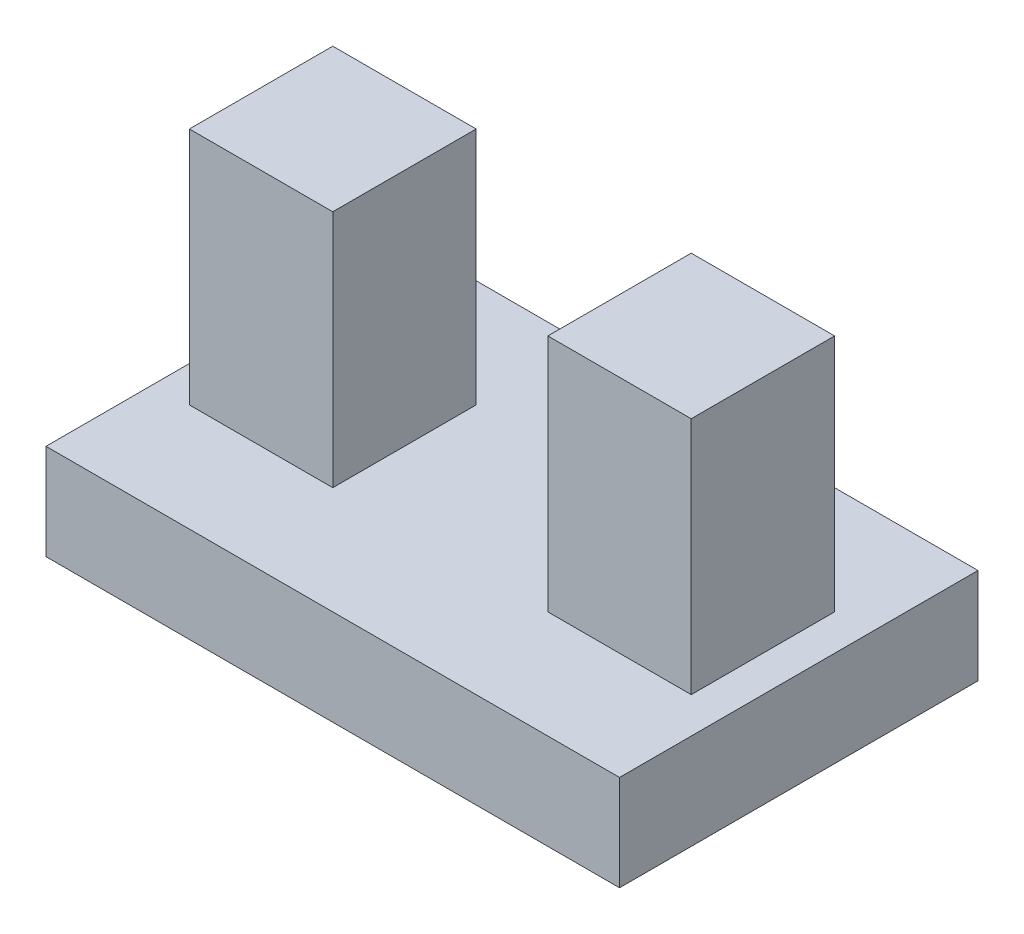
from build123d import *

# Parameters (mm, degrees)
SKETCH_1_W      = 24
SKETCH_1_H      = 15
EXTRUDE_1_DEPTH = 4
SKETCH_2_W      = 6
SKETCH_2_H      = 6
EXTRUDE_2_DEPTH = 10


with BuildPart() as part:
    # Sketch 1 → Extrude 1 (new body)
    with BuildSketch(Plane(origin=(0, 0, 0), x_dir=(1, 0, 0), z_dir=(0, 1, 0))):
        Rectangle(SKETCH_1_W, SKETCH_1_H)
    extrude(amount=EXTRUDE_1_DEPTH)

    # Sketch 2 → Extrude 2 (add)
    with BuildSketch(Plane(origin=(0, 4, 0), x_dir=(1, 0, 0), z_dir=(0, 1, 0))):
        with Locations((-7.5, 0)):
            Rectangle(SKETCH_2_W, SKETCH_2_H)
        with Locations((7.5, 0)):
            Rectangle(SKETCH_2_W, SKETCH_2_H)
    extrude(amount=EXTRUDE_2_DEPTH)


solid = part.part
